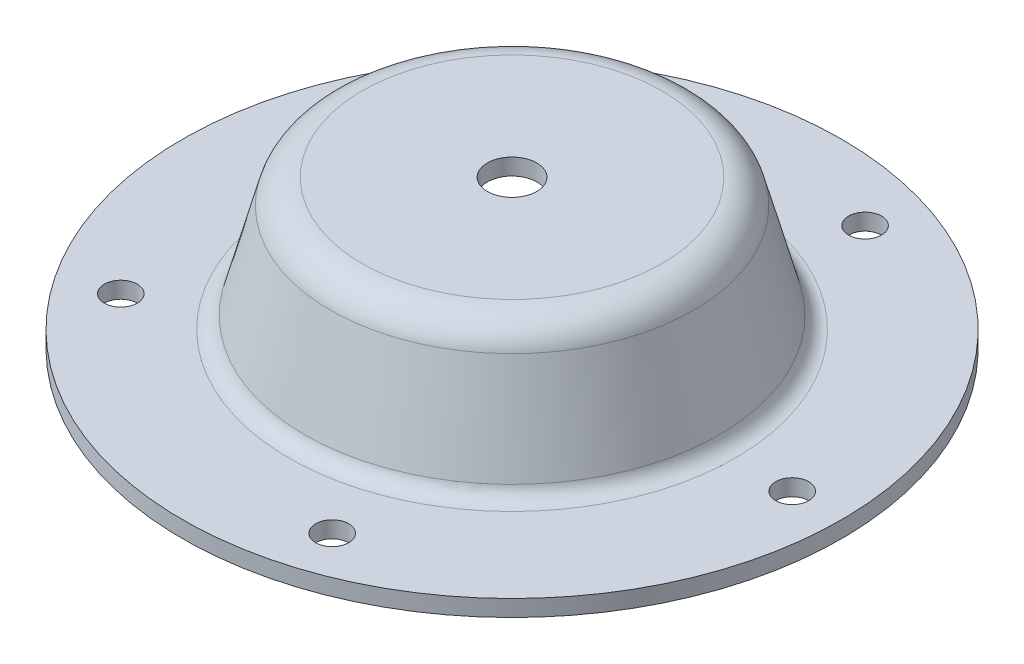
ISO-10303-21;
HEADER;
FILE_DESCRIPTION(('STEP AP214'),'2;1');
FILE_NAME('part.step','',(''),(''),'','','');
FILE_SCHEMA(('AUTOMOTIVE_DESIGN { 1 0 10303 214 1 1 1 1 }'));
ENDSEC;
DATA;
#1=APPLICATION_CONTEXT('core data for automotive mechanical design processes');
#2=APPLICATION_PROTOCOL_DEFINITION('international standard','automotive_design',2000,#1);
#3=PRODUCT_CONTEXT('',#1,'mechanical');
#4=PRODUCT('Part','Part','',(#3));
#5=PRODUCT_RELATED_PRODUCT_CATEGORY('part','',(#4));
#6=PRODUCT_DEFINITION_FORMATION('','',#4);
#7=PRODUCT_DEFINITION_CONTEXT('part definition',#1,'design');
#8=PRODUCT_DEFINITION('design','',#6,#7);
#9=PRODUCT_DEFINITION_SHAPE('','',#8);
#10=(LENGTH_UNIT() NAMED_UNIT(*) SI_UNIT(.MILLI.,.METRE.));
#11=(NAMED_UNIT(*) PLANE_ANGLE_UNIT() SI_UNIT($,.RADIAN.));
#12=(NAMED_UNIT(*) SI_UNIT($,.STERADIAN.) SOLID_ANGLE_UNIT());
#13=UNCERTAINTY_MEASURE_WITH_UNIT(LENGTH_MEASURE(1.E-05),#10,'distance_accuracy_value','');
#14=(GEOMETRIC_REPRESENTATION_CONTEXT(3) GLOBAL_UNCERTAINTY_ASSIGNED_CONTEXT((#13)) GLOBAL_UNIT_ASSIGNED_CONTEXT((#10,
#11,#12)) REPRESENTATION_CONTEXT('',''));
#15=CARTESIAN_POINT('',(0.,0.,0.));
#16=DIRECTION('',(0.,0.,1.));
#17=DIRECTION('',(1.,0.,0.));
#18=AXIS2_PLACEMENT_3D('',#15,#16,#17);
#19=CARTESIAN_POINT('',(-28.8578273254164,25.4,0.));
#20=DIRECTION('',(0.,1.,0.));
#21=DIRECTION('',(0.,0.,1.));
#22=AXIS2_PLACEMENT_3D('',#19,#20,#21);
#23=PLANE('',#22);
#24=CARTESIAN_POINT('',(0.,25.4,0.));
#25=DIRECTION('',(0.,1.,0.));
#26=DIRECTION('',(0.,0.,1.));
#27=AXIS2_PLACEMENT_3D('',#24,#25,#26);
#28=CIRCLE('',#27,4.76249999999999);
#29=CARTESIAN_POINT('',(0.,25.4,4.76249999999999));
#30=VERTEX_POINT('',#29);
#31=EDGE_CURVE('E62',#30,#30,#28,.T.);
#32=ORIENTED_EDGE('',*,*,#31,.T.);
#33=EDGE_LOOP('',(#32));
#34=FACE_BOUND('',#33,.T.);
#35=CARTESIAN_POINT('',(0.,25.4,0.));
#36=DIRECTION('',(0.,-1.,0.));
#37=DIRECTION('',(0.,0.,-1.));
#38=AXIS2_PLACEMENT_3D('',#35,#36,#37);
#39=CIRCLE('',#38,28.8578273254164);
#40=CARTESIAN_POINT('',(0.,25.4,-28.8578273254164));
#41=VERTEX_POINT('',#40);
#42=EDGE_CURVE('E59',#41,#41,#39,.T.);
#43=ORIENTED_EDGE('',*,*,#42,.T.);
#44=EDGE_LOOP('',(#43));
#45=FACE_BOUND('',#44,.T.);
#46=ADVANCED_FACE('F25',(#34,#45),#23,.F.);
#47=CARTESIAN_POINT('',(-28.8578273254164,28.575,0.));
#48=DIRECTION('',(0.,1.,0.));
#49=DIRECTION('',(0.,0.,1.));
#50=AXIS2_PLACEMENT_3D('',#47,#48,#49);
#51=PLANE('',#50);
#52=CARTESIAN_POINT('',(0.,28.575,0.));
#53=DIRECTION('',(0.,1.,0.));
#54=DIRECTION('',(0.,0.,1.));
#55=AXIS2_PLACEMENT_3D('',#52,#53,#54);
#56=CIRCLE('',#55,4.7625);
#57=CARTESIAN_POINT('',(0.,28.575,4.7625));
#58=VERTEX_POINT('',#57);
#59=EDGE_CURVE('E65',#58,#58,#56,.T.);
#60=ORIENTED_EDGE('',*,*,#59,.F.);
#61=EDGE_LOOP('',(#60));
#62=FACE_BOUND('',#61,.T.);
#63=CARTESIAN_POINT('',(0.,28.575,0.));
#64=DIRECTION('',(0.,-1.,0.));
#65=DIRECTION('',(0.,0.,-1.));
#66=AXIS2_PLACEMENT_3D('',#63,#64,#65);
#67=CIRCLE('',#66,28.8578273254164);
#68=CARTESIAN_POINT('',(0.,28.575,-28.8578273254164));
#69=VERTEX_POINT('',#68);
#70=EDGE_CURVE('E10',#69,#69,#67,.T.);
#71=ORIENTED_EDGE('',*,*,#70,.F.);
#72=EDGE_LOOP('',(#71));
#73=FACE_BOUND('',#72,.T.);
#74=ADVANCED_FACE('F138',(#62,#73),#51,.T.);
#75=CARTESIAN_POINT('',(0.,22.225,0.));
#76=DIRECTION('',(0.,-1.,0.));
#77=DIRECTION('',(0.,0.,-1.));
#78=AXIS2_PLACEMENT_3D('',#75,#76,#77);
#79=TOROIDAL_SURFACE('',#78,28.8578273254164,6.35);
#80=ORIENTED_EDGE('',*,*,#70,.T.);
#81=EDGE_LOOP('',(#80));
#82=FACE_BOUND('',#81,.T.);
#83=CARTESIAN_POINT('',(0.,23.868500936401,0.));
#84=DIRECTION('',(0.,-1.,0.));
#85=DIRECTION('',(0.,0.,-1.));
#86=AXIS2_PLACEMENT_3D('',#83,#84,#85);
#87=CIRCLE('',#86,34.991456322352);
#88=CARTESIAN_POINT('',(0.,23.868500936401,-34.991456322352));
#89=VERTEX_POINT('',#88);
#90=EDGE_CURVE('E31',#89,#89,#87,.T.);
#91=ORIENTED_EDGE('',*,*,#90,.F.);
#92=EDGE_LOOP('',(#91));
#93=FACE_BOUND('',#92,.T.);
#94=ADVANCED_FACE('F144',(#82,#93),#79,.T.);
#95=CARTESIAN_POINT('',(0.,5.5282495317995,0.));
#96=DIRECTION('',(0.,-1.,0.));
#97=DIRECTION('',(0.,0.,-1.));
#98=AXIS2_PLACEMENT_3D('',#95,#96,#97);
#99=CONICAL_SURFACE('',#98,39.9057118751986,0.261799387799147);
#100=ORIENTED_EDGE('',*,*,#90,.T.);
#101=EDGE_LOOP('',(#100));
#102=FACE_BOUND('',#101,.T.);
#103=CARTESIAN_POINT('',(0.,5.5282495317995,0.));
#104=DIRECTION('',(0.,-1.,0.));
#105=DIRECTION('',(0.,0.,-1.));
#106=AXIS2_PLACEMENT_3D('',#103,#104,#105);
#107=CIRCLE('',#106,39.9057118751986);
#108=CARTESIAN_POINT('',(0.,5.5282495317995,-39.9057118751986));
#109=VERTEX_POINT('',#108);
#110=EDGE_CURVE('E35',#109,#109,#107,.T.);
#111=ORIENTED_EDGE('',*,*,#110,.F.);
#112=EDGE_LOOP('',(#111));
#113=FACE_BOUND('',#112,.T.);
#114=ADVANCED_FACE('F236',(#102,#113),#99,.T.);
#115=CARTESIAN_POINT('',(0.,6.35,0.));
#116=DIRECTION('',(0.,-1.,0.));
#117=DIRECTION('',(0.,0.,-1.));
#118=AXIS2_PLACEMENT_3D('',#115,#116,#117);
#119=TOROIDAL_SURFACE('',#118,42.9725263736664,3.175);
#120=ORIENTED_EDGE('',*,*,#110,.T.);
#121=EDGE_LOOP('',(#120));
#122=FACE_BOUND('',#121,.T.);
#123=CARTESIAN_POINT('',(0.,3.175,0.));
#124=DIRECTION('',(0.,-1.,0.));
#125=DIRECTION('',(0.,0.,-1.));
#126=AXIS2_PLACEMENT_3D('',#123,#124,#125);
#127=CIRCLE('',#126,42.9725263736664);
#128=CARTESIAN_POINT('',(0.,3.175,-42.9725263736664));
#129=VERTEX_POINT('',#128);
#130=EDGE_CURVE('E39',#129,#129,#127,.T.);
#131=ORIENTED_EDGE('',*,*,#130,.F.);
#132=EDGE_LOOP('',(#131));
#133=FACE_BOUND('',#132,.T.);
#134=ADVANCED_FACE('F105',(#122,#133),#119,.F.);
#135=CARTESIAN_POINT('',(-63.5,3.175,0.));
#136=DIRECTION('',(0.,1.,0.));
#137=DIRECTION('',(0.,0.,1.));
#138=AXIS2_PLACEMENT_3D('',#135,#136,#137);
#139=PLANE('',#138);
#140=CARTESIAN_POINT('',(16.6791922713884,3.175,51.3332754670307));
#141=DIRECTION('',(0.,1.,0.));
#142=DIRECTION('',(0.,0.,1.));
#143=AXIS2_PLACEMENT_3D('',#140,#141,#142);
#144=CIRCLE('',#143,3.17499999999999);
#145=CARTESIAN_POINT('',(16.6791922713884,3.175,54.5082754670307));
#146=VERTEX_POINT('',#145);
#147=EDGE_CURVE('E95',#146,#146,#144,.T.);
#148=ORIENTED_EDGE('',*,*,#147,.F.);
#149=EDGE_LOOP('',(#148));
#150=FACE_BOUND('',#149,.T.);
#151=CARTESIAN_POINT('',(-43.6666922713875,3.175,31.7257089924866));
#152=DIRECTION('',(0.,1.,0.));
#153=DIRECTION('',(0.,0.,1.));
#154=AXIS2_PLACEMENT_3D('',#151,#152,#153);
#155=CIRCLE('',#154,3.17499999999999);
#156=CARTESIAN_POINT('',(-43.6666922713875,3.175,34.9007089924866));
#157=VERTEX_POINT('',#156);
#158=EDGE_CURVE('E89',#157,#157,#155,.T.);
#159=ORIENTED_EDGE('',*,*,#158,.F.);
#160=EDGE_LOOP('',(#159));
#161=FACE_BOUND('',#160,.T.);
#162=CARTESIAN_POINT('',(-43.666692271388,3.175,-31.725708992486));
#163=DIRECTION('',(0.,1.,0.));
#164=DIRECTION('',(0.,0.,1.));
#165=AXIS2_PLACEMENT_3D('',#162,#163,#164);
#166=CIRCLE('',#165,3.17499999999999);
#167=CARTESIAN_POINT('',(-43.666692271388,3.175,-28.550708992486));
#168=VERTEX_POINT('',#167);
#169=EDGE_CURVE('E83',#168,#168,#166,.T.);
#170=ORIENTED_EDGE('',*,*,#169,.F.);
#171=EDGE_LOOP('',(#170));
#172=FACE_BOUND('',#171,.T.);
#173=CARTESIAN_POINT('',(16.6791922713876,3.175,-51.333275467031));
#174=DIRECTION('',(0.,1.,0.));
#175=DIRECTION('',(0.,0.,1.));
#176=AXIS2_PLACEMENT_3D('',#173,#174,#175);
#177=CIRCLE('',#176,3.17499999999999);
#178=CARTESIAN_POINT('',(16.6791922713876,3.175,-48.158275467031));
#179=VERTEX_POINT('',#178);
#180=EDGE_CURVE('E77',#179,#179,#177,.T.);
#181=ORIENTED_EDGE('',*,*,#180,.F.);
#182=EDGE_LOOP('',(#181));
#183=FACE_BOUND('',#182,.T.);
#184=CARTESIAN_POINT('',(53.975,3.175,0.));
#185=DIRECTION('',(0.,1.,0.));
#186=DIRECTION('',(0.,0.,1.));
#187=AXIS2_PLACEMENT_3D('',#184,#185,#186);
#188=CIRCLE('',#187,3.17499999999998);
#189=CARTESIAN_POINT('',(53.975,3.175,3.17499999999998));
#190=VERTEX_POINT('',#189);
#191=EDGE_CURVE('E71',#190,#190,#188,.T.);
#192=ORIENTED_EDGE('',*,*,#191,.F.);
#193=EDGE_LOOP('',(#192));
#194=FACE_BOUND('',#193,.T.);
#195=ORIENTED_EDGE('',*,*,#130,.T.);
#196=EDGE_LOOP('',(#195));
#197=FACE_BOUND('',#196,.T.);
#198=CARTESIAN_POINT('',(0.,3.175,0.));
#199=DIRECTION('',(0.,-1.,0.));
#200=DIRECTION('',(0.,0.,-1.));
#201=AXIS2_PLACEMENT_3D('',#198,#199,#200);
#202=CIRCLE('',#201,63.5);
#203=CARTESIAN_POINT('',(0.,3.175,-63.5));
#204=VERTEX_POINT('',#203);
#205=EDGE_CURVE('E44',#204,#204,#202,.T.);
#206=ORIENTED_EDGE('',*,*,#205,.F.);
#207=EDGE_LOOP('',(#206));
#208=FACE_BOUND('',#207,.T.);
#209=ADVANCED_FACE('F101',(#150,#161,#172,#183,#194,#197,#208),#139,.T.);
#210=CARTESIAN_POINT('',(0.,0.,0.));
#211=DIRECTION('',(0.,-1.,0.));
#212=DIRECTION('',(0.,0.,-1.));
#213=AXIS2_PLACEMENT_3D('',#210,#211,#212);
#214=CYLINDRICAL_SURFACE('',#213,63.5);
#215=ORIENTED_EDGE('',*,*,#205,.T.);
#216=EDGE_LOOP('',(#215));
#217=FACE_BOUND('',#216,.T.);
#218=CARTESIAN_POINT('',(0.,0.,0.));
#219=DIRECTION('',(0.,-1.,0.));
#220=DIRECTION('',(0.,0.,-1.));
#221=AXIS2_PLACEMENT_3D('',#218,#219,#220);
#222=CIRCLE('',#221,63.5);
#223=CARTESIAN_POINT('',(0.,0.,-63.5));
#224=VERTEX_POINT('',#223);
#225=EDGE_CURVE('E47',#224,#224,#222,.T.);
#226=ORIENTED_EDGE('',*,*,#225,.F.);
#227=EDGE_LOOP('',(#226));
#228=FACE_BOUND('',#227,.T.);
#229=ADVANCED_FACE('F104',(#217,#228),#214,.T.);
#230=CARTESIAN_POINT('',(-63.5,0.,0.));
#231=DIRECTION('',(0.,1.,0.));
#232=DIRECTION('',(0.,0.,1.));
#233=AXIS2_PLACEMENT_3D('',#230,#231,#232);
#234=PLANE('',#233);
#235=CARTESIAN_POINT('',(16.6791922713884,0.,51.3332754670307));
#236=DIRECTION('',(0.,1.,0.));
#237=DIRECTION('',(0.,0.,1.));
#238=AXIS2_PLACEMENT_3D('',#235,#236,#237);
#239=CIRCLE('',#238,3.175);
#240=CARTESIAN_POINT('',(16.6791922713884,0.,54.5082754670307));
#241=VERTEX_POINT('',#240);
#242=EDGE_CURVE('E92',#241,#241,#239,.T.);
#243=ORIENTED_EDGE('',*,*,#242,.T.);
#244=EDGE_LOOP('',(#243));
#245=FACE_BOUND('',#244,.T.);
#246=CARTESIAN_POINT('',(-43.6666922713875,0.,31.7257089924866));
#247=DIRECTION('',(0.,1.,0.));
#248=DIRECTION('',(0.,0.,1.));
#249=AXIS2_PLACEMENT_3D('',#246,#247,#248);
#250=CIRCLE('',#249,3.175);
#251=CARTESIAN_POINT('',(-43.6666922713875,0.,34.9007089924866));
#252=VERTEX_POINT('',#251);
#253=EDGE_CURVE('E86',#252,#252,#250,.T.);
#254=ORIENTED_EDGE('',*,*,#253,.T.);
#255=EDGE_LOOP('',(#254));
#256=FACE_BOUND('',#255,.T.);
#257=CARTESIAN_POINT('',(-43.666692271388,0.,-31.725708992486));
#258=DIRECTION('',(0.,1.,0.));
#259=DIRECTION('',(0.,0.,1.));
#260=AXIS2_PLACEMENT_3D('',#257,#258,#259);
#261=CIRCLE('',#260,3.175);
#262=CARTESIAN_POINT('',(-43.666692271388,0.,-28.550708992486));
#263=VERTEX_POINT('',#262);
#264=EDGE_CURVE('E80',#263,#263,#261,.T.);
#265=ORIENTED_EDGE('',*,*,#264,.T.);
#266=EDGE_LOOP('',(#265));
#267=FACE_BOUND('',#266,.T.);
#268=CARTESIAN_POINT('',(16.6791922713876,0.,-51.333275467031));
#269=DIRECTION('',(0.,1.,0.));
#270=DIRECTION('',(0.,0.,1.));
#271=AXIS2_PLACEMENT_3D('',#268,#269,#270);
#272=CIRCLE('',#271,3.175);
#273=CARTESIAN_POINT('',(16.6791922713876,0.,-48.158275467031));
#274=VERTEX_POINT('',#273);
#275=EDGE_CURVE('E74',#274,#274,#272,.T.);
#276=ORIENTED_EDGE('',*,*,#275,.T.);
#277=EDGE_LOOP('',(#276));
#278=FACE_BOUND('',#277,.T.);
#279=CARTESIAN_POINT('',(53.975,0.,0.));
#280=DIRECTION('',(0.,1.,0.));
#281=DIRECTION('',(0.,0.,1.));
#282=AXIS2_PLACEMENT_3D('',#279,#280,#281);
#283=CIRCLE('',#282,3.175);
#284=CARTESIAN_POINT('',(53.975,0.,3.175));
#285=VERTEX_POINT('',#284);
#286=EDGE_CURVE('E68',#285,#285,#283,.T.);
#287=ORIENTED_EDGE('',*,*,#286,.T.);
#288=EDGE_LOOP('',(#287));
#289=FACE_BOUND('',#288,.T.);
#290=CARTESIAN_POINT('',(0.,0.,0.));
#291=DIRECTION('',(0.,-1.,0.));
#292=DIRECTION('',(0.,0.,-1.));
#293=AXIS2_PLACEMENT_3D('',#290,#291,#292);
#294=CIRCLE('',#293,42.9725263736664);
#295=CARTESIAN_POINT('',(0.,0.,-42.9725263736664));
#296=VERTEX_POINT('',#295);
#297=EDGE_CURVE('E50',#296,#296,#294,.T.);
#298=ORIENTED_EDGE('',*,*,#297,.F.);
#299=EDGE_LOOP('',(#298));
#300=FACE_BOUND('',#299,.T.);
#301=ORIENTED_EDGE('',*,*,#225,.T.);
#302=EDGE_LOOP('',(#301));
#303=FACE_BOUND('',#302,.T.);
#304=ADVANCED_FACE('F121',(#245,#256,#267,#278,#289,#300,#303),#234,.F.);
#305=CARTESIAN_POINT('',(0.,6.35,0.));
#306=DIRECTION('',(0.,-1.,0.));
#307=DIRECTION('',(0.,0.,-1.));
#308=AXIS2_PLACEMENT_3D('',#305,#306,#307);
#309=TOROIDAL_SURFACE('',#308,42.9725263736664,6.35);
#310=CARTESIAN_POINT('',(0.,4.70649906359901,0.));
#311=DIRECTION('',(0.,-1.,0.));
#312=DIRECTION('',(0.,0.,-1.));
#313=AXIS2_PLACEMENT_3D('',#310,#311,#312);
#314=CIRCLE('',#313,36.8388973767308);
#315=CARTESIAN_POINT('',(0.,4.70649906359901,-36.8388973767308));
#316=VERTEX_POINT('',#315);
#317=EDGE_CURVE('E53',#316,#316,#314,.T.);
#318=ORIENTED_EDGE('',*,*,#317,.F.);
#319=EDGE_LOOP('',(#318));
#320=FACE_BOUND('',#319,.T.);
#321=ORIENTED_EDGE('',*,*,#297,.T.);
#322=EDGE_LOOP('',(#321));
#323=FACE_BOUND('',#322,.T.);
#324=ADVANCED_FACE('F126',(#320,#323),#309,.T.);
#325=CARTESIAN_POINT('',(0.,4.70649906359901,0.));
#326=DIRECTION('',(0.,-1.,0.));
#327=DIRECTION('',(0.,0.,-1.));
#328=AXIS2_PLACEMENT_3D('',#325,#326,#327);
#329=CONICAL_SURFACE('',#328,36.8388973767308,0.261799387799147);
#330=CARTESIAN_POINT('',(0.,23.0467504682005,0.));
#331=DIRECTION('',(0.,-1.,0.));
#332=DIRECTION('',(0.,0.,-1.));
#333=AXIS2_PLACEMENT_3D('',#330,#331,#332);
#334=CIRCLE('',#333,31.9246418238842);
#335=CARTESIAN_POINT('',(0.,23.0467504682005,-31.9246418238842));
#336=VERTEX_POINT('',#335);
#337=EDGE_CURVE('E56',#336,#336,#334,.T.);
#338=ORIENTED_EDGE('',*,*,#337,.F.);
#339=EDGE_LOOP('',(#338));
#340=FACE_BOUND('',#339,.T.);
#341=ORIENTED_EDGE('',*,*,#317,.T.);
#342=EDGE_LOOP('',(#341));
#343=FACE_BOUND('',#342,.T.);
#344=ADVANCED_FACE('F133',(#340,#343),#329,.F.);
#345=CARTESIAN_POINT('',(0.,22.225,0.));
#346=DIRECTION('',(0.,-1.,0.));
#347=DIRECTION('',(0.,0.,-1.));
#348=AXIS2_PLACEMENT_3D('',#345,#346,#347);
#349=TOROIDAL_SURFACE('',#348,28.8578273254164,3.175);
#350=ORIENTED_EDGE('',*,*,#42,.F.);
#351=EDGE_LOOP('',(#350));
#352=FACE_BOUND('',#351,.T.);
#353=ORIENTED_EDGE('',*,*,#337,.T.);
#354=EDGE_LOOP('',(#353));
#355=FACE_BOUND('',#354,.T.);
#356=ADVANCED_FACE('F150',(#352,#355),#349,.F.);
#357=CARTESIAN_POINT('',(0.,28.575,0.));
#358=DIRECTION('',(0.,1.,0.));
#359=DIRECTION('',(0.,0.,1.));
#360=AXIS2_PLACEMENT_3D('',#357,#358,#359);
#361=CYLINDRICAL_SURFACE('',#360,4.76249999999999);
#362=ORIENTED_EDGE('',*,*,#59,.T.);
#363=EDGE_LOOP('',(#362));
#364=FACE_BOUND('',#363,.T.);
#365=ORIENTED_EDGE('',*,*,#31,.F.);
#366=EDGE_LOOP('',(#365));
#367=FACE_BOUND('',#366,.T.);
#368=ADVANCED_FACE('F152',(#364,#367),#361,.F.);
#369=CARTESIAN_POINT('',(53.975,3.175,0.));
#370=DIRECTION('',(0.,1.,0.));
#371=DIRECTION('',(0.,0.,1.));
#372=AXIS2_PLACEMENT_3D('',#369,#370,#371);
#373=CYLINDRICAL_SURFACE('',#372,3.17499999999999);
#374=ORIENTED_EDGE('',*,*,#286,.F.);
#375=EDGE_LOOP('',(#374));
#376=FACE_BOUND('',#375,.T.);
#377=ORIENTED_EDGE('',*,*,#191,.T.);
#378=EDGE_LOOP('',(#377));
#379=FACE_BOUND('',#378,.T.);
#380=ADVANCED_FACE('F168',(#376,#379),#373,.F.);
#381=CARTESIAN_POINT('',(16.6791922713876,3.175,-51.333275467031));
#382=DIRECTION('',(0.,1.,0.));
#383=DIRECTION('',(0.,0.,1.));
#384=AXIS2_PLACEMENT_3D('',#381,#382,#383);
#385=CYLINDRICAL_SURFACE('',#384,3.17499999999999);
#386=ORIENTED_EDGE('',*,*,#275,.F.);
#387=EDGE_LOOP('',(#386));
#388=FACE_BOUND('',#387,.T.);
#389=ORIENTED_EDGE('',*,*,#180,.T.);
#390=EDGE_LOOP('',(#389));
#391=FACE_BOUND('',#390,.T.);
#392=ADVANCED_FACE('F172',(#388,#391),#385,.F.);
#393=CARTESIAN_POINT('',(-43.666692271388,3.175,-31.725708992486));
#394=DIRECTION('',(0.,1.,0.));
#395=DIRECTION('',(0.,0.,1.));
#396=AXIS2_PLACEMENT_3D('',#393,#394,#395);
#397=CYLINDRICAL_SURFACE('',#396,3.17499999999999);
#398=ORIENTED_EDGE('',*,*,#264,.F.);
#399=EDGE_LOOP('',(#398));
#400=FACE_BOUND('',#399,.T.);
#401=ORIENTED_EDGE('',*,*,#169,.T.);
#402=EDGE_LOOP('',(#401));
#403=FACE_BOUND('',#402,.T.);
#404=ADVANCED_FACE('F175',(#400,#403),#397,.F.);
#405=CARTESIAN_POINT('',(-43.6666922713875,3.175,31.7257089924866));
#406=DIRECTION('',(0.,1.,0.));
#407=DIRECTION('',(0.,0.,1.));
#408=AXIS2_PLACEMENT_3D('',#405,#406,#407);
#409=CYLINDRICAL_SURFACE('',#408,3.17499999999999);
#410=ORIENTED_EDGE('',*,*,#253,.F.);
#411=EDGE_LOOP('',(#410));
#412=FACE_BOUND('',#411,.T.);
#413=ORIENTED_EDGE('',*,*,#158,.T.);
#414=EDGE_LOOP('',(#413));
#415=FACE_BOUND('',#414,.T.);
#416=ADVANCED_FACE('F179',(#412,#415),#409,.F.);
#417=CARTESIAN_POINT('',(16.6791922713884,3.175,51.3332754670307));
#418=DIRECTION('',(0.,1.,0.));
#419=DIRECTION('',(0.,0.,1.));
#420=AXIS2_PLACEMENT_3D('',#417,#418,#419);
#421=CYLINDRICAL_SURFACE('',#420,3.17499999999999);
#422=ORIENTED_EDGE('',*,*,#242,.F.);
#423=EDGE_LOOP('',(#422));
#424=FACE_BOUND('',#423,.T.);
#425=ORIENTED_EDGE('',*,*,#147,.T.);
#426=EDGE_LOOP('',(#425));
#427=FACE_BOUND('',#426,.T.);
#428=ADVANCED_FACE('F99',(#424,#427),#421,.F.);
#429=CLOSED_SHELL('',(#46,#74,#94,#114,#134,#209,#229,#304,#324,#344,#356,#368,#380,#392,#404,
#416,#428));
#430=MANIFOLD_SOLID_BREP('B2',#429);
#431=ADVANCED_BREP_SHAPE_REPRESENTATION('',(#18,#430),#14);
#432=SHAPE_DEFINITION_REPRESENTATION(#9,#431);
ENDSEC;
END-ISO-10303-21;
